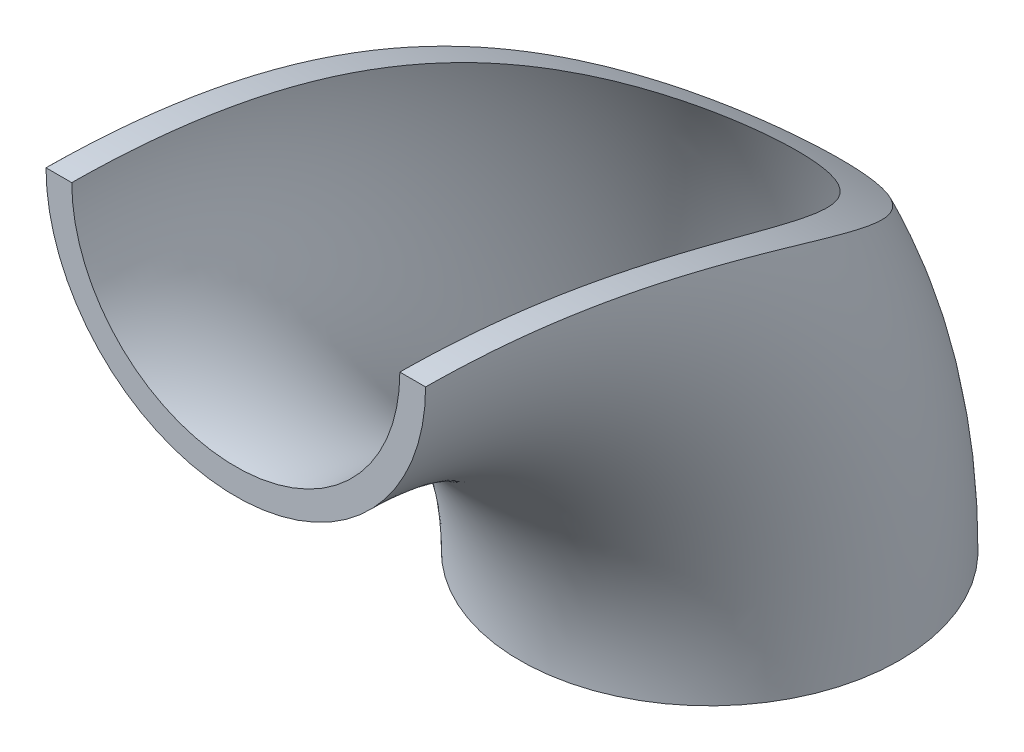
ISO-10303-21;
HEADER;
FILE_DESCRIPTION(('STEP AP214'),'2;1');
FILE_NAME('part.step','',(''),(''),'','','');
FILE_SCHEMA(('AUTOMOTIVE_DESIGN { 1 0 10303 214 1 1 1 1 }'));
ENDSEC;
DATA;
#1=APPLICATION_CONTEXT('core data for automotive mechanical design processes');
#2=APPLICATION_PROTOCOL_DEFINITION('international standard','automotive_design',2000,#1);
#3=PRODUCT_CONTEXT('',#1,'mechanical');
#4=PRODUCT('Part','Part','',(#3));
#5=PRODUCT_RELATED_PRODUCT_CATEGORY('part','',(#4));
#6=PRODUCT_DEFINITION_FORMATION('','',#4);
#7=PRODUCT_DEFINITION_CONTEXT('part definition',#1,'design');
#8=PRODUCT_DEFINITION('design','',#6,#7);
#9=PRODUCT_DEFINITION_SHAPE('','',#8);
#10=(LENGTH_UNIT() NAMED_UNIT(*) SI_UNIT(.MILLI.,.METRE.));
#11=(NAMED_UNIT(*) PLANE_ANGLE_UNIT() SI_UNIT($,.RADIAN.));
#12=(NAMED_UNIT(*) SI_UNIT($,.STERADIAN.) SOLID_ANGLE_UNIT());
#13=UNCERTAINTY_MEASURE_WITH_UNIT(LENGTH_MEASURE(1.E-05),#10,'distance_accuracy_value','');
#14=(GEOMETRIC_REPRESENTATION_CONTEXT(3) GLOBAL_UNCERTAINTY_ASSIGNED_CONTEXT((#13)) GLOBAL_UNIT_ASSIGNED_CONTEXT((#10,
#11,#12)) REPRESENTATION_CONTEXT('',''));
#15=CARTESIAN_POINT('',(0.,0.,0.));
#16=DIRECTION('',(0.,0.,1.));
#17=DIRECTION('',(1.,0.,0.));
#18=AXIS2_PLACEMENT_3D('',#15,#16,#17);
#19=CARTESIAN_POINT('',(0.,-95.,0.));
#20=DIRECTION('',(1.,0.,0.));
#21=DIRECTION('',(0.,0.,-1.));
#22=AXIS2_PLACEMENT_3D('',#19,#20,#21);
#23=TOROIDAL_SURFACE('',#22,95.,32.89);
#24=CARTESIAN_POINT('',(0.,-95.,-95.));
#25=DIRECTION('',(0.,1.,0.));
#26=DIRECTION('',(1.,0.,0.));
#27=AXIS2_PLACEMENT_3D('',#24,#25,#26);
#28=CIRCLE('',#27,32.89);
#29=CARTESIAN_POINT('',(32.89,-95.,-95.));
#30=VERTEX_POINT('',#29);
#31=EDGE_CURVE('E71',#30,#30,#28,.T.);
#32=ORIENTED_EDGE('',*,*,#31,.F.);
#33=EDGE_LOOP('',(#32));
#34=FACE_BOUND('',#33,.T.);
#35=CARTESIAN_POINT('',(0.,0.,0.));
#36=DIRECTION('',(0.,0.,1.));
#37=DIRECTION('',(1.,0.,0.));
#38=AXIS2_PLACEMENT_3D('',#35,#36,#37);
#39=CIRCLE('',#38,32.89);
#40=CARTESIAN_POINT('',(-32.89,0.,0.));
#41=VERTEX_POINT('',#40);
#42=CARTESIAN_POINT('',(32.89,0.,0.));
#43=VERTEX_POINT('',#42);
#44=EDGE_CURVE('E72',#41,#43,#39,.T.);
#45=ORIENTED_EDGE('',*,*,#44,.T.);
#46=CARTESIAN_POINT('',(32.89,0.,0.));
#47=CARTESIAN_POINT('',(32.8899901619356,-0.00647090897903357,-0.915127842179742));
#48=CARTESIAN_POINT('',(32.8899978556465,-0.0189742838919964,-1.83021320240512));
#49=CARTESIAN_POINT('',(32.89000200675,-0.0561118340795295,-3.66013993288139));
#50=CARTESIAN_POINT('',(32.8899984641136,-0.0807460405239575,-4.57498130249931));
#51=CARTESIAN_POINT('',(32.889933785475,-0.142265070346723,-6.40586285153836));
#52=CARTESIAN_POINT('',(32.8898725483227,-0.179171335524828,-7.32190231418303));
#53=CARTESIAN_POINT('',(32.8895725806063,-0.265277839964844,-9.15339625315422));
#54=CARTESIAN_POINT('',(32.8893338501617,-0.314478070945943,-10.0688507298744));
#55=CARTESIAN_POINT('',(32.8881167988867,-0.480742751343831,-12.8165305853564));
#56=CARTESIAN_POINT('',(32.8866369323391,-0.61639077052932,-14.6476688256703));
#57=CARTESIAN_POINT('',(32.8804006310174,-0.937623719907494,-18.3072687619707));
#58=CARTESIAN_POINT('',(32.8756411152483,-1.12325550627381,-20.1357263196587));
#59=CARTESIAN_POINT('',(32.8601016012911,-1.54464821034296,-23.7879077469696));
#60=CARTESIAN_POINT('',(32.8493181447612,-1.7804378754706,-25.6116282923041));
#61=CARTESIAN_POINT('',(32.8182925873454,-2.30211310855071,-29.252252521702));
#62=CARTESIAN_POINT('',(32.7980482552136,-2.58801048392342,-31.0691544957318));
#63=CARTESIAN_POINT('',(32.7432544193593,-3.21858923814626,-34.7462647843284));
#64=CARTESIAN_POINT('',(32.7083108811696,-3.56472271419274,-36.6062187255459));
#65=CARTESIAN_POINT('',(32.6190434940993,-4.30919359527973,-40.3144926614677));
#66=CARTESIAN_POINT('',(32.5647267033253,-4.70751195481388,-42.1628166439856));
#67=CARTESIAN_POINT('',(32.4310446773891,-5.55554972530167,-45.8456382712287));
#68=CARTESIAN_POINT('',(32.3516937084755,-6.00523976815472,-47.6801431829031));
#69=CARTESIAN_POINT('',(32.1616708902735,-6.95495822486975,-51.3331728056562));
#70=CARTESIAN_POINT('',(32.0510199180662,-7.45495294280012,-53.1517073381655));
#71=CARTESIAN_POINT('',(31.7914600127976,-8.50394616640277,-56.7706567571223));
#72=CARTESIAN_POINT('',(31.6425744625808,-9.05291458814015,-58.5710820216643));
#73=CARTESIAN_POINT('',(31.2988105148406,-10.1982879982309,-62.1517845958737));
#74=CARTESIAN_POINT('',(31.1039478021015,-10.7946767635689,-63.9320685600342));
#75=CARTESIAN_POINT('',(30.7503759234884,-11.7796200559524,-66.7463902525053));
#76=CARTESIAN_POINT('',(30.6094714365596,-12.1534264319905,-67.7878658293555));
#77=CARTESIAN_POINT('',(30.3065268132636,-12.9163414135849,-69.8621624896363));
#78=CARTESIAN_POINT('',(30.1444861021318,-13.3054504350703,-70.8949833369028));
#79=CARTESIAN_POINT('',(29.7971006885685,-14.0983405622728,-72.9511659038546));
#80=CARTESIAN_POINT('',(29.611753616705,-14.5021231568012,-73.9745266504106));
#81=CARTESIAN_POINT('',(29.2153463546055,-15.3236687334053,-76.0109898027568));
#82=CARTESIAN_POINT('',(29.0042785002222,-15.7414358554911,-77.024089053));
#83=CARTESIAN_POINT('',(28.5537260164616,-16.5901862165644,-79.039201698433));
#84=CARTESIAN_POINT('',(28.3142229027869,-17.0211779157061,-80.0412074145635));
#85=CARTESIAN_POINT('',(27.8052951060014,-17.8928194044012,-82.0270868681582));
#86=CARTESIAN_POINT('',(27.5360258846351,-18.3334101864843,-83.0110261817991));
#87=CARTESIAN_POINT('',(26.963383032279,-19.2250475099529,-84.9643526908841));
#88=CARTESIAN_POINT('',(26.6600046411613,-19.6760955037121,-85.9337378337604));
#89=CARTESIAN_POINT('',(26.015767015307,-20.5867192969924,-87.8552720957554));
#90=CARTESIAN_POINT('',(25.6749279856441,-21.0462903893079,-88.8074301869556));
#91=CARTESIAN_POINT('',(24.9518894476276,-21.9717974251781,-90.6917385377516));
#92=CARTESIAN_POINT('',(24.5697240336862,-22.4377278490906,-91.6239045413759));
#93=CARTESIAN_POINT('',(23.7594080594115,-23.3735755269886,-93.4654029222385));
#94=CARTESIAN_POINT('',(23.3312831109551,-23.8434904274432,-94.3747476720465));
#95=CARTESIAN_POINT('',(22.590368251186,-24.6114730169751,-95.8377425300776));
#96=CARTESIAN_POINT('',(22.2929737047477,-24.9092643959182,-96.3993603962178));
#97=CARTESIAN_POINT('',(21.6760979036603,-25.5042397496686,-97.5107342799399));
#98=CARTESIAN_POINT('',(21.3566160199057,-25.8014237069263,-98.06048995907));
#99=CARTESIAN_POINT('',(20.6937713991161,-26.394160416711,-99.1469071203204));
#100=CARTESIAN_POINT('',(20.3503942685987,-26.6897120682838,-99.6835604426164));
#101=CARTESIAN_POINT('',(19.6381975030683,-27.2775709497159,-100.741567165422));
#102=CARTESIAN_POINT('',(19.2693786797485,-27.5698782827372,-101.26292105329));
#103=CARTESIAN_POINT('',(18.5071956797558,-28.1474512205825,-102.284404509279));
#104=CARTESIAN_POINT('',(18.1140282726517,-28.4327524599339,-102.784660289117));
#105=CARTESIAN_POINT('',(17.2988153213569,-28.9964962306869,-103.76531181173));
#106=CARTESIAN_POINT('',(16.87676654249,-29.2749379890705,-104.245705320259));
#107=CARTESIAN_POINT('',(16.0025455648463,-29.8220745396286,-105.182632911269));
#108=CARTESIAN_POINT('',(15.5504192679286,-30.0907832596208,-105.639201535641));
#109=CARTESIAN_POINT('',(14.6137648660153,-30.6158611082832,-106.525179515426));
#110=CARTESIAN_POINT('',(14.1292496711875,-30.8722350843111,-106.954599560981));
#111=CARTESIAN_POINT('',(13.2333609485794,-31.3160406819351,-107.693232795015));
#112=CARTESIAN_POINT('',(12.8284921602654,-31.5064947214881,-108.008519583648));
#113=CARTESIAN_POINT('',(11.9971253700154,-31.8755972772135,-108.616708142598));
#114=CARTESIAN_POINT('',(11.5706299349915,-32.0542471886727,-108.909612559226));
#115=CARTESIAN_POINT('',(10.6954035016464,-32.3976017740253,-109.470180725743));
#116=CARTESIAN_POINT('',(10.2466561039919,-32.5622959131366,-109.737825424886));
#117=CARTESIAN_POINT('',(9.32743345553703,-32.8750454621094,-110.244170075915));
#118=CARTESIAN_POINT('',(8.85695741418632,-33.0231002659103,-110.482868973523));
#119=CARTESIAN_POINT('',(7.89008818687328,-33.3012785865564,-110.929912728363));
#120=CARTESIAN_POINT('',(7.39347310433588,-33.4311953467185,-111.137908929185));
#121=CARTESIAN_POINT('',(6.38082038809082,-33.6682795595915,-111.516470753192));
#122=CARTESIAN_POINT('',(5.86478304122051,-33.7754473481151,-111.687036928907));
#123=CARTESIAN_POINT('',(4.81687049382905,-33.9640854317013,-111.986666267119));
#124=CARTESIAN_POINT('',(4.28501659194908,-34.0455887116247,-112.115782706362));
#125=CARTESIAN_POINT('',(3.208915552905,-34.1806307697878,-112.329434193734));
#126=CARTESIAN_POINT('',(2.66466992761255,-34.2341729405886,-112.413974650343));
#127=CARTESIAN_POINT('',(1.6103767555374,-34.3086108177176,-112.531438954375));
#128=CARTESIAN_POINT('',(1.10086289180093,-34.3316729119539,-112.567788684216));
#129=CARTESIAN_POINT('',(0.0800502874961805,-34.3517384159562,-112.599417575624));
#130=CARTESIAN_POINT('',(-0.431248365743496,-34.3487430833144,-112.594698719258));
#131=CARTESIAN_POINT('',(-1.45104242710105,-34.3167833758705,-112.544314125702));
#132=CARTESIAN_POINT('',(-1.95953750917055,-34.2878160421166,-112.498643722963));
#133=CARTESIAN_POINT('',(-2.96925775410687,-34.2047626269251,-112.367527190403));
#134=CARTESIAN_POINT('',(-3.47048306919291,-34.1506770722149,-112.28208189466));
#135=CARTESIAN_POINT('',(-4.40997408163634,-34.025789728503,-112.084405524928));
#136=CARTESIAN_POINT('',(-4.84934726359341,-33.9573242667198,-111.975904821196));
#137=CARTESIAN_POINT('',(-5.71688949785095,-33.8028716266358,-111.730616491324));
#138=CARTESIAN_POINT('',(-6.14505981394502,-33.7168864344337,-111.593832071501));
#139=CARTESIAN_POINT('',(-6.98851744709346,-33.5289650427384,-111.294131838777));
#140=CARTESIAN_POINT('',(-7.40380436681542,-33.4270283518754,-111.131215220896));
#141=CARTESIAN_POINT('',(-8.22039129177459,-33.2088250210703,-110.781464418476));
#142=CARTESIAN_POINT('',(-8.62168787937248,-33.0925549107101,-110.59462444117));
#143=CARTESIAN_POINT('',(-9.32226486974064,-32.874478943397,-110.243045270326));
#144=CARTESIAN_POINT('',(-9.6244752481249,-32.7751630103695,-110.082559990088));
#145=CARTESIAN_POINT('',(-10.2196466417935,-32.5696120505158,-109.749511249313));
#146=CARTESIAN_POINT('',(-10.5126092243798,-32.463378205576,-109.576949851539));
#147=CARTESIAN_POINT('',(-11.3778491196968,-32.1352329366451,-109.042382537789));
#148=CARTESIAN_POINT('',(-11.9363010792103,-31.9039338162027,-108.663583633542));
#149=CARTESIAN_POINT('',(-13.0175778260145,-31.42104365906,-107.867510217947));
#150=CARTESIAN_POINT('',(-13.5403184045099,-31.1694075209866,-107.45014987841));
#151=CARTESIAN_POINT('',(-14.5502586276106,-30.6506347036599,-106.583515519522));
#152=CARTESIAN_POINT('',(-15.0374594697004,-30.3834985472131,-106.134242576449));
#153=CARTESIAN_POINT('',(-16.0268338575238,-29.8091085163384,-105.16076647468));
#154=CARTESIAN_POINT('',(-16.5253467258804,-29.5005625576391,-104.633618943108));
#155=CARTESIAN_POINT('',(-17.4844038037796,-28.8728256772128,-103.551374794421));
#156=CARTESIAN_POINT('',(-17.9449257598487,-28.5536286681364,-102.996262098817));
#157=CARTESIAN_POINT('',(-18.8305880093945,-27.9078894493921,-101.862466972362));
#158=CARTESIAN_POINT('',(-19.2557208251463,-27.5813457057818,-101.283779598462));
#159=CARTESIAN_POINT('',(-20.073845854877,-26.9230405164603,-100.105390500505));
#160=CARTESIAN_POINT('',(-20.4667850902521,-26.5912715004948,-99.5056563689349));
#161=CARTESIAN_POINT('',(-21.2221672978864,-25.9252470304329,-98.2889908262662));
#162=CARTESIAN_POINT('',(-21.5846194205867,-25.5909923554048,-97.672064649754));
#163=CARTESIAN_POINT('',(-22.2814853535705,-24.9216192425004,-96.4230572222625));
#164=CARTESIAN_POINT('',(-22.6158985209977,-24.5865007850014,-95.7909756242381));
#165=CARTESIAN_POINT('',(-23.2470769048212,-23.9290354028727,-94.5367727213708));
#166=CARTESIAN_POINT('',(-23.5447698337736,-23.6066679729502,-93.9151274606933));
#167=CARTESIAN_POINT('',(-24.1178202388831,-22.9635025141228,-92.6607797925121));
#168=CARTESIAN_POINT('',(-24.3931759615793,-22.6427046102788,-92.0280765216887));
#169=CARTESIAN_POINT('',(-24.9232722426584,-22.0033923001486,-90.752376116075));
#170=CARTESIAN_POINT('',(-25.1779989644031,-21.6848795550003,-90.1093724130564));
#171=CARTESIAN_POINT('',(-25.6680832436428,-21.0511022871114,-88.8144105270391));
#172=CARTESIAN_POINT('',(-25.9034396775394,-20.7358379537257,-88.1624518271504));
#173=CARTESIAN_POINT('',(-26.3561355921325,-20.1091595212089,-86.8502844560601));
#174=CARTESIAN_POINT('',(-26.5734708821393,-19.7977463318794,-86.1900739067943));
#175=CARTESIAN_POINT('',(-26.9912696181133,-19.1794023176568,-84.8622441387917));
#176=CARTESIAN_POINT('',(-27.1917323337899,-18.8724716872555,-84.1946246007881));
#177=CARTESIAN_POINT('',(-27.7703338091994,-17.9578360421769,-82.1786745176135));
#178=CARTESIAN_POINT('',(-28.1247281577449,-17.3576308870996,-80.8200618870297));
#179=CARTESIAN_POINT('',(-28.778041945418,-16.1808074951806,-78.0803523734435));
#180=CARTESIAN_POINT('',(-29.0769839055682,-15.6041797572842,-76.6992648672));
#181=CARTESIAN_POINT('',(-29.626413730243,-14.4767131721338,-73.9171625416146));
#182=CARTESIAN_POINT('',(-29.8769024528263,-13.9258738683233,-72.5161480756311));
#183=CARTESIAN_POINT('',(-30.3767846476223,-12.7551143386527,-69.4424873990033));
#184=CARTESIAN_POINT('',(-30.6178373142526,-12.1406461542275,-67.7664113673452));
#185=CARTESIAN_POINT('',(-31.0495775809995,-10.952678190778,-64.3927567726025));
#186=CARTESIAN_POINT('',(-31.240246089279,-10.37919400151,-62.6951703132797));
#187=CARTESIAN_POINT('',(-31.5788397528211,-9.27510331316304,-59.2809981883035));
#188=CARTESIAN_POINT('',(-31.726743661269,-8.74451822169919,-57.5644035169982));
#189=CARTESIAN_POINT('',(-31.9865896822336,-7.72786722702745,-54.1147690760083));
#190=CARTESIAN_POINT('',(-32.0985192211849,-7.24181693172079,-52.3817237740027));
#191=CARTESIAN_POINT('',(-32.2925480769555,-6.31559078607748,-48.9017699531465));
#192=CARTESIAN_POINT('',(-32.374647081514,-5.87541541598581,-47.1548612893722));
#193=CARTESIAN_POINT('',(-32.5146543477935,-5.04170584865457,-43.648527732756));
#194=CARTESIAN_POINT('',(-32.5725563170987,-4.64818380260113,-41.8890997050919));
#195=CARTESIAN_POINT('',(-32.6692192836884,-3.90866619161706,-38.360371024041));
#196=CARTESIAN_POINT('',(-32.7079864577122,-3.56265531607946,-36.5910737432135));
#197=CARTESIAN_POINT('',(-32.7709751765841,-2.91851582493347,-33.043968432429));
#198=CARTESIAN_POINT('',(-32.7952001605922,-2.62037590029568,-31.2661625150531));
#199=CARTESIAN_POINT('',(-32.8331537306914,-2.07218758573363,-27.7034314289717));
#200=CARTESIAN_POINT('',(-32.8468844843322,-1.8221292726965,-25.9185078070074));
#201=CARTESIAN_POINT('',(-32.8673308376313,-1.37016322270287,-22.3429045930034));
#202=CARTESIAN_POINT('',(-32.8740479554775,-1.16824507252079,-20.5522263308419));
#203=CARTESIAN_POINT('',(-32.8806881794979,-0.912918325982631,-17.9789037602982));
#204=CARTESIAN_POINT('',(-32.8823057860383,-0.84004355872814,-17.1981507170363));
#205=CARTESIAN_POINT('',(-32.8849364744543,-0.703377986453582,-15.6359064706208));
#206=CARTESIAN_POINT('',(-32.8859496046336,-0.639586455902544,-14.8544153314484));
#207=CARTESIAN_POINT('',(-32.8875428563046,-0.521066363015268,-13.2907874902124));
#208=CARTESIAN_POINT('',(-32.8881229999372,-0.466337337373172,-12.5086508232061));
#209=CARTESIAN_POINT('',(-32.8889927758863,-0.365916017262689,-10.9438160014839));
#210=CARTESIAN_POINT('',(-32.8892824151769,-0.320223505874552,-10.1611178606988));
#211=CARTESIAN_POINT('',(-32.8896866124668,-0.237957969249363,-8.59737994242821));
#212=CARTESIAN_POINT('',(-32.8898016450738,-0.201360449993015,-7.81634145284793));
#213=CARTESIAN_POINT('',(-32.8899445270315,-0.137090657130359,-6.25387800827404));
#214=CARTESIAN_POINT('',(-32.8899723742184,-0.109418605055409,-5.4724530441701));
#215=CARTESIAN_POINT('',(-32.8900008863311,-0.062963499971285,-3.90930261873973));
#216=CARTESIAN_POINT('',(-32.8900015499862,-0.0441808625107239,-3.12757714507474));
#217=CARTESIAN_POINT('',(-32.8899984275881,-0.0154636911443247,-1.56391132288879));
#218=CARTESIAN_POINT('',(-32.8899946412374,-0.00552974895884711,-0.781970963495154));
#219=CARTESIAN_POINT('',(-32.89,0.,0.));
#220=B_SPLINE_CURVE_WITH_KNOTS('',3,(#46,#47,#48,#49,#50,#51,#52,#53,#54,#55,#56,#57,#58,#59,
#60,#61,#62,#63,#64,#65,#66,#67,#68,#69,#70,#71,#72,#73,#74,#75,#76,#77,#78,#79,#80,#81,#82,#83,
#84,#85,#86,#87,#88,#89,#90,#91,#92,#93,#94,#95,#96,#97,#98,#99,#100,#101,#102,#103,#104,#105,
#106,#107,#108,#109,#110,#111,#112,#113,#114,#115,#116,#117,#118,#119,#120,#121,#122,#123,#124,
#125,#126,#127,#128,#129,#130,#131,#132,#133,#134,#135,#136,#137,#138,#139,#140,#141,#142,#143,
#144,#145,#146,#147,#148,#149,#150,#151,#152,#153,#154,#155,#156,#157,#158,#159,#160,#161,#162,
#163,#164,#165,#166,#167,#168,#169,#170,#171,#172,#173,#174,#175,#176,#177,#178,#179,#180,#181,
#182,#183,#184,#185,#186,#187,#188,#189,#190,#191,#192,#193,#194,#195,#196,#197,#198,#199,#200,
#201,#202,#203,#204,#205,#206,#207,#208,#209,#210,#211,#212,#213,#214,#215,#216,#217,#218,#219),
.UNSPECIFIED.,.F.,.F.,(4,2,2,2,2,2,2,2,2,2,2,2,2,2,2,2,2,2,2,2,2,2,2,2,2,2,2,2,2,2,2,2,2,2,2,2,
2,2,2,2,2,2,2,2,2,2,2,2,2,2,2,2,2,2,2,2,2,2,2,2,2,2,2,2,2,2,2,2,2,2,2,2,2,2,2,2,2,2,2,2,2,2,2,2,
2,2,4),(0.,2.74543209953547,5.49087125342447,8.24113267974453,10.9913922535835,16.4991237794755,
22.012036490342,27.5281174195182,33.0454999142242,38.721294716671,44.3950238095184,
50.0655254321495,55.7322537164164,61.3955246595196,67.0568664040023,70.4029651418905,
73.7491548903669,77.0956851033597,80.4432149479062,83.7929328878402,87.1259160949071,
90.4593650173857,93.791024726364,97.1199564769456,100.447042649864,102.552091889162,
104.65720111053,106.763589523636,108.869910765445,110.961001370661,113.052326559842,
115.140530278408,117.227906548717,118.869079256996,120.510057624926,122.15226388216,
123.794529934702,125.454207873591,127.113861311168,128.771372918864,130.428683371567,
131.96040888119,133.492060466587,135.023886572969,136.555680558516,137.927464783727,
139.299093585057,140.670764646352,142.042768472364,143.11127075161,144.179590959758,
146.316849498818,148.458985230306,150.601048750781,152.964599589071,155.329525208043,
157.694949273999,160.064190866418,162.432718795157,164.80130101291,167.083593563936,
169.366065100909,171.65005511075,173.934177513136,176.21882959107,178.503580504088,
183.082846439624,187.660248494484,192.237569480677,197.640202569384,203.044879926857,
208.452237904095,213.861483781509,219.27078628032,224.681494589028,230.09045516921,
235.498136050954,240.904699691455,246.310092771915,248.66249749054,251.01471420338,
253.366810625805,255.718850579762,258.064485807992,260.410179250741,262.755982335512,
265.101942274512),.UNSPECIFIED.);
#221=EDGE_CURVE('E49',#43,#41,#220,.T.);
#222=ORIENTED_EDGE('',*,*,#221,.T.);
#223=EDGE_LOOP('',(#45,#222));
#224=FACE_BOUND('',#223,.T.);
#225=ADVANCED_FACE('F34',(#34,#224),#23,.F.);
#226=CARTESIAN_POINT('',(0.,-95.,0.));
#227=DIRECTION('',(1.,0.,0.));
#228=DIRECTION('',(0.,0.,-1.));
#229=AXIS2_PLACEMENT_3D('',#226,#227,#228);
#230=TOROIDAL_SURFACE('',#229,95.,38.05);
#231=CARTESIAN_POINT('',(38.05,0.,0.));
#232=CARTESIAN_POINT('',(38.0499812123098,-0.00785931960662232,-1.1116872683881));
#233=CARTESIAN_POINT('',(38.0499969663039,-0.0246229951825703,-2.22331373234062));
#234=CARTESIAN_POINT('',(38.0500012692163,-0.0760726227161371,-4.44614958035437));
#235=CARTESIAN_POINT('',(38.0499898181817,-0.110758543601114,-5.55735896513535));
#236=CARTESIAN_POINT('',(38.0498434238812,-0.198165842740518,-7.77905862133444));
#237=CARTESIAN_POINT('',(38.0497084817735,-0.250887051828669,-8.8895488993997));
#238=CARTESIAN_POINT('',(38.0490894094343,-0.374455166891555,-11.1095076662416));
#239=CARTESIAN_POINT('',(38.0486052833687,-0.445301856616,-12.2189761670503));
#240=CARTESIAN_POINT('',(38.046972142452,-0.605193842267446,-14.4365898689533));
#241=CARTESIAN_POINT('',(38.0458231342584,-0.694238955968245,-15.5447350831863));
#242=CARTESIAN_POINT('',(38.0424367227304,-0.891328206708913,-17.7678233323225));
#243=CARTESIAN_POINT('',(38.0401911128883,-0.999511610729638,-18.882754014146));
#244=CARTESIAN_POINT('',(38.034097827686,-1.23444476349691,-21.1106571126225));
#245=CARTESIAN_POINT('',(38.0302501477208,-1.36119456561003,-22.2236295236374));
#246=CARTESIAN_POINT('',(38.020356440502,-1.63327572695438,-24.4473097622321));
#247=CARTESIAN_POINT('',(38.0143103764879,-1.77860739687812,-25.5580175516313));
#248=CARTESIAN_POINT('',(37.9993438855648,-2.08784874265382,-27.7768688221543));
#249=CARTESIAN_POINT('',(37.9904233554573,-2.25175908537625,-28.8850122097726));
#250=CARTESIAN_POINT('',(37.9689529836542,-2.59812962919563,-31.0984202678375));
#251=CARTESIAN_POINT('',(37.9564029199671,-2.7805909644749,-32.2036847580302));
#252=CARTESIAN_POINT('',(37.9149093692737,-3.31911510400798,-35.3038727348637));
#253=CARTESIAN_POINT('',(37.8809175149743,-3.69619985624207,-37.2951249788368));
#254=CARTESIAN_POINT('',(37.7929845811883,-4.51044120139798,-41.2652279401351));
#255=CARTESIAN_POINT('',(37.7390398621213,-4.94760874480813,-43.2440763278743));
#256=CARTESIAN_POINT('',(37.6050924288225,-5.88127860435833,-47.1874429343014));
#257=CARTESIAN_POINT('',(37.5250825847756,-6.37779713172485,-49.1519570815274));
#258=CARTESIAN_POINT('',(37.3322356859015,-7.42917290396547,-53.0647119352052));
#259=CARTESIAN_POINT('',(37.2193832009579,-7.98405749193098,-55.0129445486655));
#260=CARTESIAN_POINT('',(36.9533563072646,-9.15091600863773,-58.8912433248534));
#261=CARTESIAN_POINT('',(36.8001490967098,-9.7629361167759,-60.8212933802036));
#262=CARTESIAN_POINT('',(36.4456204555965,-11.0405379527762,-64.6552950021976));
#263=CARTESIAN_POINT('',(36.2443862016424,-11.7060212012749,-66.5592873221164));
#264=CARTESIAN_POINT('',(35.7846720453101,-13.0889899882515,-70.3415170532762));
#265=CARTESIAN_POINT('',(35.5261878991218,-13.8064793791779,-72.2197525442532));
#266=CARTESIAN_POINT('',(34.9421715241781,-15.289619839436,-75.9450344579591));
#267=CARTESIAN_POINT('',(34.6166921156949,-16.0552326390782,-77.7921042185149));
#268=CARTESIAN_POINT('',(34.069799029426,-17.2364184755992,-80.5355234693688));
#269=CARTESIAN_POINT('',(33.8778405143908,-17.6353863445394,-81.4449870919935));
#270=CARTESIAN_POINT('',(33.472742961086,-18.4437232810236,-83.2545107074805));
#271=CARTESIAN_POINT('',(33.2596047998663,-18.8530919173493,-84.1545710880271));
#272=CARTESIAN_POINT('',(32.810635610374,-19.6811761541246,-85.9437760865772));
#273=CARTESIAN_POINT('',(32.5748227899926,-20.0998840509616,-86.8329288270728));
#274=CARTESIAN_POINT('',(32.0785386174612,-20.9460904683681,-88.6000647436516));
#275=CARTESIAN_POINT('',(31.8180680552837,-21.3735887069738,-89.4780482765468));
#276=CARTESIAN_POINT('',(31.1460370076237,-22.4325075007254,-91.6180924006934));
#277=CARTESIAN_POINT('',(30.7196081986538,-23.0683097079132,-92.8733672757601));
#278=CARTESIAN_POINT('',(29.8035022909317,-24.3529561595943,-95.3542464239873));
#279=CARTESIAN_POINT('',(29.3138175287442,-25.0018019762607,-96.5798470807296));
#280=CARTESIAN_POINT('',(28.5258454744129,-25.9814526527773,-98.3922917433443));
#281=CARTESIAN_POINT('',(28.2541319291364,-26.3092314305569,-98.9924064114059));
#282=CARTESIAN_POINT('',(27.6918302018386,-26.9661003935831,-100.182979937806));
#283=CARTESIAN_POINT('',(27.4012431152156,-27.2951905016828,-100.773439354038));
#284=CARTESIAN_POINT('',(26.8025675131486,-27.9510962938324,-101.938856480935));
#285=CARTESIAN_POINT('',(26.4946473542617,-28.2779077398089,-102.513902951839));
#286=CARTESIAN_POINT('',(25.8579169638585,-28.9310844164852,-103.652521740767));
#287=CARTESIAN_POINT('',(25.5291083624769,-29.2574496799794,-104.216094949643));
#288=CARTESIAN_POINT('',(24.8495038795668,-29.9084942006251,-105.330245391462));
#289=CARTESIAN_POINT('',(24.4987218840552,-30.2331743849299,-105.880830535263));
#290=CARTESIAN_POINT('',(23.7736061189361,-30.8798392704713,-106.967972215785));
#291=CARTESIAN_POINT('',(23.3992713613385,-31.2018238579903,-107.504528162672));
#292=CARTESIAN_POINT('',(22.6262524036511,-31.8411367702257,-108.561069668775));
#293=CARTESIAN_POINT('',(22.2276083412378,-32.1584717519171,-109.08108049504));
#294=CARTESIAN_POINT('',(21.4040123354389,-32.7872995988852,-110.103402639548));
#295=CARTESIAN_POINT('',(20.9790643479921,-33.0987933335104,-110.605716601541));
#296=CARTESIAN_POINT('',(20.0999937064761,-33.7149566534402,-111.591897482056));
#297=CARTESIAN_POINT('',(19.6457875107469,-34.0196030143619,-112.075704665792));
#298=CARTESIAN_POINT('',(18.707907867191,-34.6187665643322,-113.020490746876));
#299=CARTESIAN_POINT('',(18.2242369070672,-34.9132846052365,-113.481471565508));
#300=CARTESIAN_POINT('',(17.2254245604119,-35.4898591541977,-114.377951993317));
#301=CARTESIAN_POINT('',(16.7102457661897,-35.7719001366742,-114.813420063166));
#302=CARTESIAN_POINT('',(15.6478132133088,-36.3199759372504,-115.654462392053));
#303=CARTESIAN_POINT('',(15.1005586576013,-36.5860103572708,-116.060035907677));
#304=CARTESIAN_POINT('',(13.967795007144,-37.1009064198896,-116.840637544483));
#305=CARTESIAN_POINT('',(13.3819648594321,-37.3495752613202,-117.21532916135));
#306=CARTESIAN_POINT('',(12.1768742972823,-37.8225918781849,-117.924518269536));
#307=CARTESIAN_POINT('',(11.5576120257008,-38.0469383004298,-118.259013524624));
#308=CARTESIAN_POINT('',(10.2877738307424,-38.4662482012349,-118.881525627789));
#309=CARTESIAN_POINT('',(9.63724835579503,-38.6612570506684,-119.169614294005));
#310=CARTESIAN_POINT('',(8.30662118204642,-39.0173210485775,-119.693801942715));
#311=CARTESIAN_POINT('',(7.62652910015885,-39.1783871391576,-119.929917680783));
#312=CARTESIAN_POINT('',(6.39935965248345,-39.4294111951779,-120.296942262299));
#313=CARTESIAN_POINT('',(5.85736638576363,-39.5272081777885,-120.439563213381));
#314=CARTESIAN_POINT('',(4.76111552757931,-39.6977649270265,-120.687908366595));
#315=CARTESIAN_POINT('',(4.20685957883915,-39.7705280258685,-120.793637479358));
#316=CARTESIAN_POINT('',(3.08977792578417,-39.8893699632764,-120.966153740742));
#317=CARTESIAN_POINT('',(2.52695707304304,-39.9354633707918,-121.032962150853));
#318=CARTESIAN_POINT('',(1.39637561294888,-39.9999380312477,-121.126376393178));
#319=CARTESIAN_POINT('',(0.828614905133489,-40.0183187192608,-121.15298140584));
#320=CARTESIAN_POINT('',(-0.308422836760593,-40.0269197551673,-121.165433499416));
#321=CARTESIAN_POINT('',(-0.877700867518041,-40.0170977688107,-121.151219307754));
#322=CARTESIAN_POINT('',(-2.01259478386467,-39.9694457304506,-121.08220318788));
#323=CARTESIAN_POINT('',(-2.5782106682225,-39.9316156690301,-121.027401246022));
#324=CARTESIAN_POINT('',(-3.70190608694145,-39.8288407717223,-120.878313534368));
#325=CARTESIAN_POINT('',(-4.25998267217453,-39.7638856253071,-120.784012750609));
#326=CARTESIAN_POINT('',(-5.36477808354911,-39.60834068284,-120.557760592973));
#327=CARTESIAN_POINT('',(-5.91149665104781,-39.5177503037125,-120.42580836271));
#328=CARTESIAN_POINT('',(-6.98713587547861,-39.3134945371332,-120.127565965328));
#329=CARTESIAN_POINT('',(-7.51614780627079,-39.1999800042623,-119.961500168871));
#330=CARTESIAN_POINT('',(-8.55774048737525,-38.9516481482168,-119.597147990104));
#331=CARTESIAN_POINT('',(-9.07032170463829,-38.816831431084,-119.398862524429));
#332=CARTESIAN_POINT('',(-10.0775444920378,-38.5281021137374,-118.97278364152));
#333=CARTESIAN_POINT('',(-10.5721835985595,-38.3741869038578,-118.744986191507));
#334=CARTESIAN_POINT('',(-11.5425754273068,-38.0494504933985,-118.262563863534));
#335=CARTESIAN_POINT('',(-12.018323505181,-37.8786251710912,-118.007932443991));
#336=CARTESIAN_POINT('',(-12.8668001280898,-37.554157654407,-117.52228287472));
#337=CARTESIAN_POINT('',(-13.2427190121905,-37.4029174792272,-117.295203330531));
#338=CARTESIAN_POINT('',(-13.9812517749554,-37.0916335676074,-116.826144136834));
#339=CARTESIAN_POINT('',(-14.3438676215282,-36.9315911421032,-116.584166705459));
#340=CARTESIAN_POINT('',(-15.4122905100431,-36.4396064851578,-115.837456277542));
#341=CARTESIAN_POINT('',(-16.0984153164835,-36.0959067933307,-115.312094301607));
#342=CARTESIAN_POINT('',(-17.420861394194,-35.3838621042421,-114.214265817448));
#343=CARTESIAN_POINT('',(-18.0570597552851,-35.0154601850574,-113.641689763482));
#344=CARTESIAN_POINT('',(-19.2806030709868,-34.260760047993,-112.457721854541));
#345=CARTESIAN_POINT('',(-19.8679507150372,-33.874462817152,-111.846332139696));
#346=CARTESIAN_POINT('',(-20.9034596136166,-33.1539036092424,-110.694500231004));
#347=CARTESIAN_POINT('',(-21.3585778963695,-32.8215978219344,-110.159040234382));
#348=CARTESIAN_POINT('',(-22.2388079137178,-32.150297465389,-109.067909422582));
#349=CARTESIAN_POINT('',(-22.663915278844,-31.811301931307,-108.512235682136));
#350=CARTESIAN_POINT('',(-23.4860661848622,-31.1285114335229,-107.382821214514));
#351=CARTESIAN_POINT('',(-23.8830937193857,-30.7847138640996,-106.809070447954));
#352=CARTESIAN_POINT('',(-24.6505418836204,-30.0942330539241,-105.645815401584));
#353=CARTESIAN_POINT('',(-25.0209636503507,-29.7475499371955,-105.056311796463));
#354=CARTESIAN_POINT('',(-25.7372976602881,-29.0523164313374,-103.862481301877));
#355=CARTESIAN_POINT('',(-26.0831793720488,-28.7037642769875,-103.258137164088));
#356=CARTESIAN_POINT('',(-26.7514854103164,-28.0064582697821,-102.036744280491));
#357=CARTESIAN_POINT('',(-27.0739094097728,-27.6577044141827,-101.419695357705));
#358=CARTESIAN_POINT('',(-27.6966806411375,-26.9611373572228,-100.174237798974));
#359=CARTESIAN_POINT('',(-27.9970320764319,-26.6133239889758,-99.5458313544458));
#360=CARTESIAN_POINT('',(-28.577056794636,-25.9195072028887,-98.2786125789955));
#361=CARTESIAN_POINT('',(-28.856730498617,-25.5735037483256,-97.6398004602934));
#362=CARTESIAN_POINT('',(-29.5328004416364,-24.7102838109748,-96.0281264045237));
#363=CARTESIAN_POINT('',(-29.9169500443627,-24.1947020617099,-95.0492341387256));
#364=CARTESIAN_POINT('',(-30.6453270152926,-23.17159518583,-93.0721918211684));
#365=CARTESIAN_POINT('',(-30.9895406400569,-22.6640728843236,-92.0740352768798));
#366=CARTESIAN_POINT('',(-31.6415478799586,-21.6589066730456,-90.0603895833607));
#367=CARTESIAN_POINT('',(-31.9493242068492,-21.1612675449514,-89.0448924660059));
#368=CARTESIAN_POINT('',(-32.5315069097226,-20.1775548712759,-86.9984819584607));
#369=CARTESIAN_POINT('',(-32.8059032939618,-19.6914848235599,-85.9675640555));
#370=CARTESIAN_POINT('',(-33.324055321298,-18.7324448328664,-83.8921945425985));
#371=CARTESIAN_POINT('',(-33.5678142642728,-18.2594734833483,-82.8477444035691));
#372=CARTESIAN_POINT('',(-34.0285681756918,-17.3252064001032,-80.7408287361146));
#373=CARTESIAN_POINT('',(-34.2454127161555,-16.8639868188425,-79.6782966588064));
#374=CARTESIAN_POINT('',(-34.6531621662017,-15.9570200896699,-77.5422204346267));
#375=CARTESIAN_POINT('',(-34.8440768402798,-15.5112671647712,-76.4686805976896));
#376=CARTESIAN_POINT('',(-35.2022785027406,-14.6359512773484,-74.3113134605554));
#377=CARTESIAN_POINT('',(-35.3695689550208,-14.2063859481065,-73.2274876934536));
#378=CARTESIAN_POINT('',(-35.682631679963,-13.3641042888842,-71.0502604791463));
#379=CARTESIAN_POINT('',(-35.8284044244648,-12.951387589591,-69.9568592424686));
#380=CARTESIAN_POINT('',(-36.1003722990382,-12.1434112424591,-67.7612081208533));
#381=CARTESIAN_POINT('',(-36.2265670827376,-11.7481519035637,-66.658958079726));
#382=CARTESIAN_POINT('',(-36.5304967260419,-10.7474921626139,-63.7928355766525));
#383=CARTESIAN_POINT('',(-36.6946525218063,-10.1558544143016,-62.0226884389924));
#384=CARTESIAN_POINT('',(-36.9848459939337,-9.0198024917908,-58.4637583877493));
#385=CARTESIAN_POINT('',(-37.1108733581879,-8.47540112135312,-56.6749705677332));
#386=CARTESIAN_POINT('',(-37.3309724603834,-7.43517188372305,-53.080537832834));
#387=CARTESIAN_POINT('',(-37.425030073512,-6.93936555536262,-51.2748858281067));
#388=CARTESIAN_POINT('',(-37.5868219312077,-5.99748760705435,-47.6485923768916));
#389=CARTESIAN_POINT('',(-37.6545436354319,-5.5514397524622,-45.8279442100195));
#390=CARTESIAN_POINT('',(-37.7688264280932,-4.71001844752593,-42.1735468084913));
#391=CARTESIAN_POINT('',(-37.8153788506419,-4.31466579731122,-40.3397925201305));
#392=CARTESIAN_POINT('',(-37.8920330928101,-3.57535802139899,-36.6611101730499));
#393=CARTESIAN_POINT('',(-37.9221305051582,-3.23141668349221,-34.8161792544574));
#394=CARTESIAN_POINT('',(-37.9696779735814,-2.60118069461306,-31.1505353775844));
#395=CARTESIAN_POINT('',(-37.9873459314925,-2.31395983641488,-29.3299842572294));
#396=CARTESIAN_POINT('',(-38.0144327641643,-1.78982620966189,-25.6818925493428));
#397=CARTESIAN_POINT('',(-38.0238529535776,-1.55290542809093,-23.854353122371));
#398=CARTESIAN_POINT('',(-38.0374334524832,-1.1294282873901,-20.1941707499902));
#399=CARTESIAN_POINT('',(-38.0415958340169,-0.942852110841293,-18.3615301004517));
#400=CARTESIAN_POINT('',(-38.0470524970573,-0.619917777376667,-14.6930056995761));
#401=CARTESIAN_POINT('',(-38.0483486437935,-0.483527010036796,-12.8571248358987));
#402=CARTESIAN_POINT('',(-38.0494152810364,-0.316321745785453,-10.1019478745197));
#403=CARTESIAN_POINT('',(-38.0496246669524,-0.266830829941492,-9.18374754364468));
#404=CARTESIAN_POINT('',(-38.0498878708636,-0.180217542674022,-7.34675665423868));
#405=CARTESIAN_POINT('',(-38.0499416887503,-0.143095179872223,-6.42796609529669));
#406=CARTESIAN_POINT('',(-38.04999859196,-0.0812024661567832,-4.59110946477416));
#407=CARTESIAN_POINT('',(-38.0500017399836,-0.0564168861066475,-3.67304390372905));
#408=CARTESIAN_POINT('',(-38.0499981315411,-0.0190625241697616,-1.83666648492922));
#409=CARTESIAN_POINT('',(-38.0499913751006,-0.0064937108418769,-0.918354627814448));
#410=CARTESIAN_POINT('',(-38.05,0.,0.));
#411=B_SPLINE_CURVE_WITH_KNOTS('',3,(#231,#232,#233,#234,#235,#236,#237,#238,#239,#240,#241,
#242,#243,#244,#245,#246,#247,#248,#249,#250,#251,#252,#253,#254,#255,#256,#257,#258,#259,#260,
#261,#262,#263,#264,#265,#266,#267,#268,#269,#270,#271,#272,#273,#274,#275,#276,#277,#278,#279,
#280,#281,#282,#283,#284,#285,#286,#287,#288,#289,#290,#291,#292,#293,#294,#295,#296,#297,#298,
#299,#300,#301,#302,#303,#304,#305,#306,#307,#308,#309,#310,#311,#312,#313,#314,#315,#316,#317,
#318,#319,#320,#321,#322,#323,#324,#325,#326,#327,#328,#329,#330,#331,#332,#333,#334,#335,#336,
#337,#338,#339,#340,#341,#342,#343,#344,#345,#346,#347,#348,#349,#350,#351,#352,#353,#354,#355,
#356,#357,#358,#359,#360,#361,#362,#363,#364,#365,#366,#367,#368,#369,#370,#371,#372,#373,#374,
#375,#376,#377,#378,#379,#380,#381,#382,#383,#384,#385,#386,#387,#388,#389,#390,#391,#392,#393,
#394,#395,#396,#397,#398,#399,#400,#401,#402,#403,#404,#405,#406,#407,#408,#409,#410),
.UNSPECIFIED.,.F.,.F.,(4,2,2,2,2,2,2,2,2,2,2,2,2,2,2,2,2,2,2,2,2,2,2,2,2,2,2,2,2,2,2,2,2,2,2,2,
2,2,2,2,2,2,2,2,2,2,2,2,2,2,2,2,2,2,2,2,2,2,2,2,2,2,2,2,2,2,2,2,2,2,2,2,2,2,2,2,2,2,2,2,2,2,2,2,
2,2,2,2,2,4),(0.,3.33511267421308,6.67021956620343,10.0052951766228,13.3403309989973,
16.6753334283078,20.0356852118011,23.396046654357,26.7564642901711,30.1170025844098,
33.4777464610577,39.5574471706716,45.6382574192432,51.7207324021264,57.8060696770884,
63.8963686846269,69.9756958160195,76.0554737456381,82.1304765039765,85.1647379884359,
88.1988738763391,91.2305933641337,94.2622157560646,98.671589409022,103.08149775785,
105.288652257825,107.495678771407,109.684083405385,111.872317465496,114.059182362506,
116.246139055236,118.429577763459,120.612688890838,122.802336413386,124.991799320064,
127.183914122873,129.376083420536,131.589633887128,133.803307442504,136.013521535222,
138.223022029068,139.928039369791,141.632829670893,143.336687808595,145.04058067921,
146.747032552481,148.453484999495,150.160586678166,151.867727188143,153.563979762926,
155.260184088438,156.956620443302,158.653471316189,160.04641673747,161.4391552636,
164.22557074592,167.018643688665,169.811562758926,172.142723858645,174.474223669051,
176.807041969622,179.139760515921,181.475332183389,183.810936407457,186.146094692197,
188.481205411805,191.99368106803,195.507361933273,199.022703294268,202.539094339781,
206.055106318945,209.589960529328,213.123479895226,216.656480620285,220.189403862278,
223.722389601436,229.34198704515,234.963102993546,240.586699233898,246.212969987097,
251.841541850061,257.47162051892,263.000357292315,268.52821265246,274.053888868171,
279.575968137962,282.334499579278,285.093032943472,287.848152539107,290.603265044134),.UNSPECIFIED.);
#412=CARTESIAN_POINT('',(38.05,0.,0.));
#413=VERTEX_POINT('',#412);
#414=CARTESIAN_POINT('',(-38.05,0.,0.));
#415=VERTEX_POINT('',#414);
#416=EDGE_CURVE('E59',#413,#415,#411,.T.);
#417=ORIENTED_EDGE('',*,*,#416,.F.);
#418=CARTESIAN_POINT('',(0.,0.,0.));
#419=DIRECTION('',(0.,0.,1.));
#420=DIRECTION('',(1.,0.,0.));
#421=AXIS2_PLACEMENT_3D('',#418,#419,#420);
#422=CIRCLE('',#421,38.05);
#423=EDGE_CURVE('E68',#415,#413,#422,.T.);
#424=ORIENTED_EDGE('',*,*,#423,.F.);
#425=EDGE_LOOP('',(#417,#424));
#426=FACE_BOUND('',#425,.T.);
#427=CARTESIAN_POINT('',(0.,-95.,-95.));
#428=DIRECTION('',(0.,1.,0.));
#429=DIRECTION('',(1.,0.,0.));
#430=AXIS2_PLACEMENT_3D('',#427,#428,#429);
#431=CIRCLE('',#430,38.05);
#432=CARTESIAN_POINT('',(38.05,-95.,-95.));
#433=VERTEX_POINT('',#432);
#434=EDGE_CURVE('E64',#433,#433,#431,.T.);
#435=ORIENTED_EDGE('',*,*,#434,.T.);
#436=EDGE_LOOP('',(#435));
#437=FACE_BOUND('',#436,.T.);
#438=ADVANCED_FACE('F36',(#426,#437),#230,.T.);
#439=CARTESIAN_POINT('',(0.,-95.,-95.));
#440=DIRECTION('',(0.,1.,0.));
#441=DIRECTION('',(1.,0.,0.));
#442=AXIS2_PLACEMENT_3D('',#439,#440,#441);
#443=PLANE('',#442);
#444=ORIENTED_EDGE('',*,*,#31,.T.);
#445=EDGE_LOOP('',(#444));
#446=FACE_BOUND('',#445,.T.);
#447=ORIENTED_EDGE('',*,*,#434,.F.);
#448=EDGE_LOOP('',(#447));
#449=FACE_BOUND('',#448,.T.);
#450=ADVANCED_FACE('F81',(#446,#449),#443,.F.);
#451=CARTESIAN_POINT('',(0.,0.,0.));
#452=DIRECTION('',(0.,0.,1.));
#453=DIRECTION('',(1.,0.,0.));
#454=AXIS2_PLACEMENT_3D('',#451,#452,#453);
#455=PLANE('',#454);
#456=DIRECTION('',(-1.,0.,0.));
#457=VECTOR('',#456,1.);
#458=CARTESIAN_POINT('',(65.,0.,0.));
#459=LINE('',#458,#457);
#460=EDGE_CURVE('E11',#415,#41,#459,.F.);
#461=ORIENTED_EDGE('',*,*,#460,.F.);
#462=ORIENTED_EDGE('',*,*,#423,.T.);
#463=EDGE_CURVE('E39',#43,#413,#459,.F.);
#464=ORIENTED_EDGE('',*,*,#463,.F.);
#465=ORIENTED_EDGE('',*,*,#44,.F.);
#466=EDGE_LOOP('',(#461,#462,#464,#465));
#467=FACE_BOUND('',#466,.T.);
#468=ADVANCED_FACE('F70',(#467),#455,.T.);
#469=CARTESIAN_POINT('',(65.,-43.8176247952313,-126.514533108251));
#470=CARTESIAN_POINT('',(65.,0.483330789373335,-65.5483209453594));
#471=CARTESIAN_POINT('',(65.,0.,2.9536990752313));
#472=B_SPLINE_CURVE_WITH_KNOTS('',2,(#469,#470,#471),.UNSPECIFIED.,.F.,.F.,(3,3),(0.,1.),.UNSPECIFIED.);
#473=DIRECTION('',(-1.,0.,0.));
#474=VECTOR('',#473,1.);
#475=SURFACE_OF_LINEAR_EXTRUSION('',#472,#474);
#476=ORIENTED_EDGE('',*,*,#460,.T.);
#477=ORIENTED_EDGE('',*,*,#221,.F.);
#478=ORIENTED_EDGE('',*,*,#463,.T.);
#479=ORIENTED_EDGE('',*,*,#416,.T.);
#480=EDGE_LOOP('',(#476,#477,#478,#479));
#481=FACE_BOUND('',#480,.T.);
#482=ADVANCED_FACE('F58',(#481),#475,.F.);
#483=CLOSED_SHELL('',(#225,#438,#450,#468,#482));
#484=MANIFOLD_SOLID_BREP('B2',#483);
#485=ADVANCED_BREP_SHAPE_REPRESENTATION('',(#18,#484),#14);
#486=SHAPE_DEFINITION_REPRESENTATION(#9,#485);
ENDSEC;
END-ISO-10303-21;
